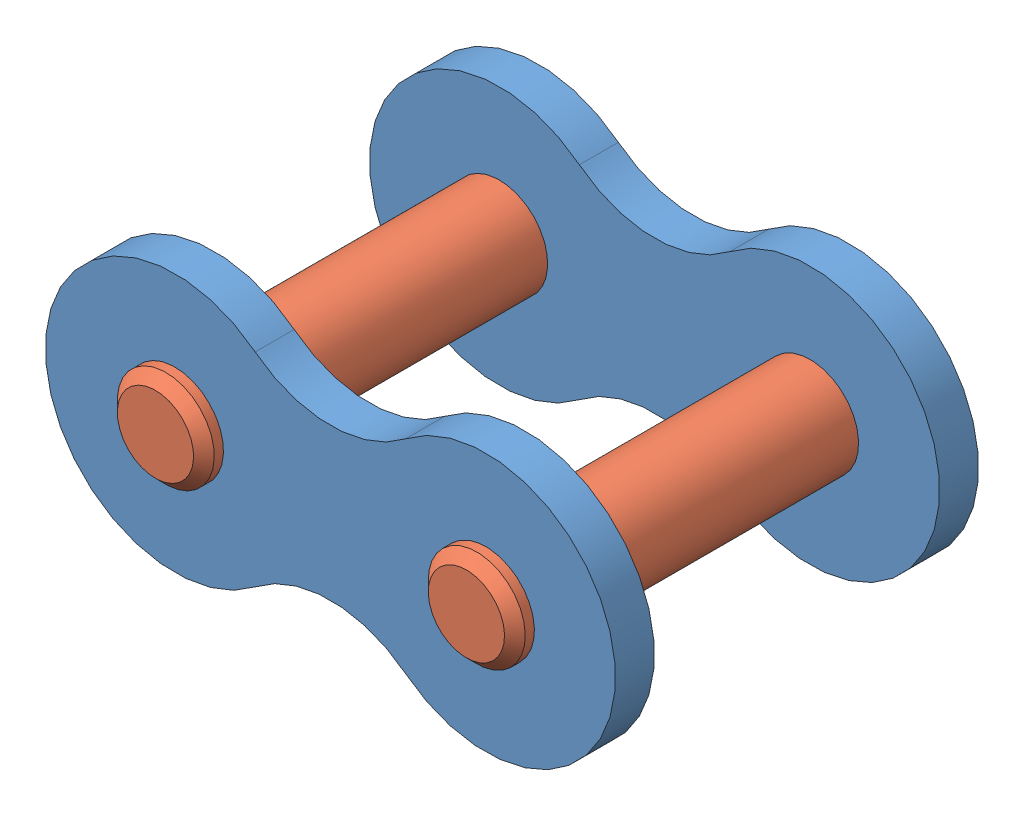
SolidWorks assembly Inside Link.SLDASM, configuration Default (file format 15000). Lengths in mm.
Overall size (34.92 15.88 24.64).
4 component instances, 2 part files, 7 mates.
Components (placement in the parent):
- Link Plate-1: Link Plate.SLDPRT [Outside] at origin size (34.92 15.88 2.39)
- Link Plate-2: Link Plate.SLDPRT [Outside] at (0 0 -19.8628) size (34.92 15.88 2.39)
- Pin-1: Pin.SLDPRT [Default] at (0 0 -8.7376) x (0.88892 -0.458063 0) z (0 0 1) size (5.94 5.94 24.64)
- Pin-2: Pin.SLDPRT [Default] at (19.05 0 -8.7376) x (0.99923 0.039231 0) z (0 0 1) size (5.94 5.94 24.64)
Mates (geometry in assembly coordinates):
- Concentric1: concentric aligned: cylinder of Link Plate-1 through (0 0 2.3876) axis (0 0 -1) radius 2.9718; cylinder of Pin-1 through (0 0 3.5814) axis (0 0 -1) radius 2.9718
- Concentric2: concentric aligned: cylinder of Link Plate-1 through (19.05 0 2.3876) axis (0 0 -1) radius 2.9718; cylinder of Pin-2 through (19.05 0 3.5814) axis (0 0 -1) radius 2.9718
- Concentric3: concentric aligned: cylinder of Link Plate-2 through (0 0 -17.4752) axis (0 0 -1) radius 2.9718; cylinder of Pin-1 through (0 0 3.5814) axis (0 0 -1) radius 2.9718
- Concentric4: concentric aligned: cylinder of Link Plate-2 through (19.05 0 -17.4752) axis (0 0 -1) radius 2.9718; cylinder of Pin-2 through (19.05 0 3.5814) axis (0 0 -1) radius 2.9718
- Distance1: distance = 17.4752 mm anti-aligned: plane of Link Plate-1 through (4.7625 -6.0378 0) normal (0 0 -1); plane of Link Plate-2 through (4.7625 -6.0378 -17.4752) normal (0 0 1)
- Distance2: distance = 1.1938 mm aligned: plane of Link Plate-1 through (4.7625 -6.0378 2.3876) normal (0 0 1); plane of Pin-1 through (0 0 3.5814) normal (0 0 1)
- Coincident1: coincident aligned: plane of Pin-1 through (0 0 3.5814) normal (0 0 1); plane of Pin-2 through (19.05 0 3.5814) normal (0 0 1)
